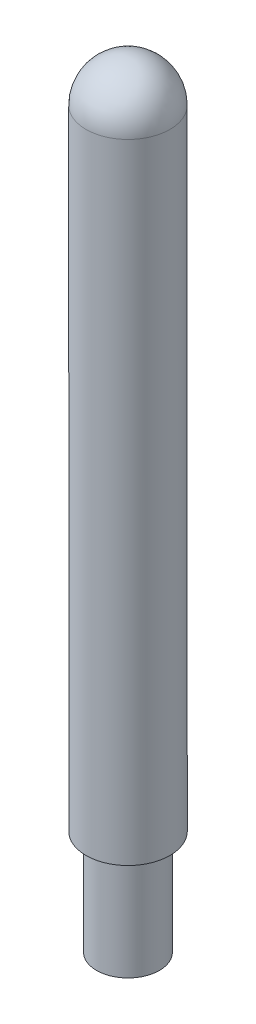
from build123d import *

# Parameters (mm, degrees)
SKETCH1_R      = 3
EXTRUDE1_DEPTH = 10
SKETCH2_R      = 4
EXTRUDE2_DEPTH = 60


with BuildPart() as part:
    # Sketch1 → Extrude1 (new body)
    with BuildSketch(Plane(origin=(0, 0, 0), x_dir=(1, 0, 0), z_dir=(0, 1, 0))):
        with Locations(Location((0, 0, 0), (0, 0, 270))):
            Circle(SKETCH1_R)
    extrude(amount=EXTRUDE1_DEPTH)

    # Sketch2 → Extrude2 (add)
    with BuildSketch(Plane(origin=(0, 10, 0), x_dir=(1, 0, 0), z_dir=(0, 1, 0))):
        with Locations(Location((0, 0, 0), (0, 0, 270))):
            Circle(SKETCH2_R)
    extrude(amount=EXTRUDE2_DEPTH)

    # Sketch3 → Revolve1 (revolve)
    with BuildSketch(Plane.XY):
        with BuildLine():
            Line((0, 74), (0, 70))
            Line((0, 70), (4, 70))
            ThreePointArc((4, 70), (2.828427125, 72.828427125), (0, 74))
        make_face()
    revolve(axis=Axis((0, 74, 0), (0, -1, 0)))


solid = part.part
